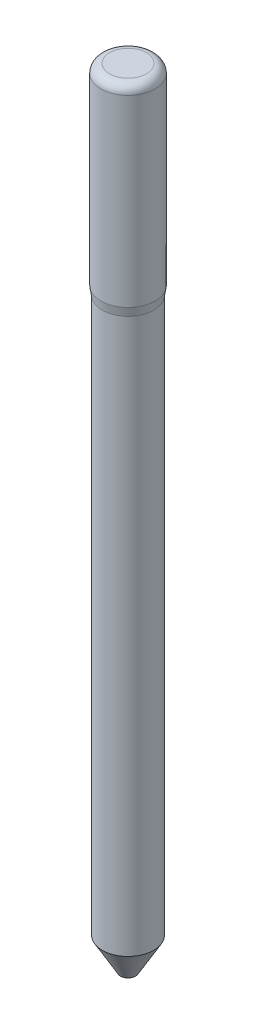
from build123d import *


with BuildPart() as part:
    # Sketch1 → Revolve1 (revolve)
    with BuildSketch(Plane.XY, mode=Mode.PRIVATE) as revolve1_sk:
        with BuildLine():
            Line((0, 0), (0.215384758, 0))
            Line((0.215384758, 0), (0.735, 0.9))
            Line((0.735, 0.9), (0.735, 16.75))
            Line((0.735, 16.75), (0.775, 17))
            Line((0.775, 17), (0.775, 22.25))
            ThreePointArc((0.775, 22.25), (0.701776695, 22.426776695), (0.525, 22.5))
            Line((0.525, 22.5), (0, 22.5))
            Line((0, 22.5), (0, 0))
        make_face()
    revolve(revolve1_sk.sketch.rotate(Axis((0, 0, 0), (0, 1, 0)), 90), axis=Axis((0, 0, 0), (0, 1, 0)))


solid = part.part
